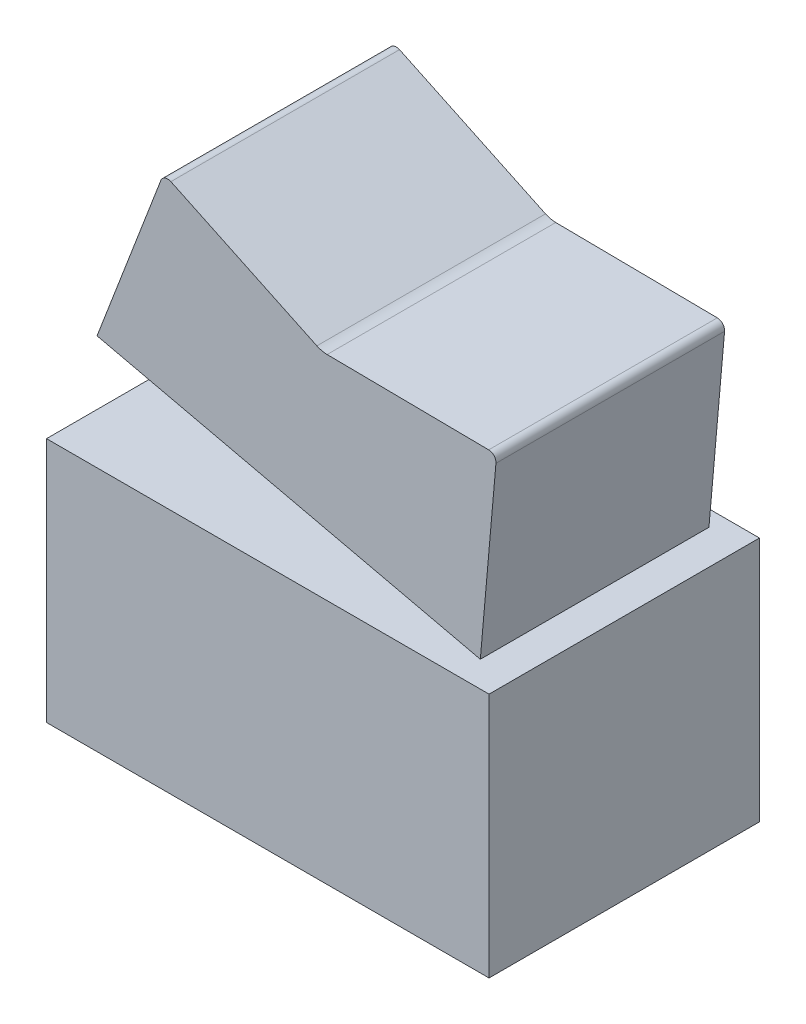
ISO-10303-21;
HEADER;
FILE_DESCRIPTION(('STEP AP214'),'2;1');
FILE_NAME('part.step','',(''),(''),'','','');
FILE_SCHEMA(('AUTOMOTIVE_DESIGN { 1 0 10303 214 1 1 1 1 }'));
ENDSEC;
DATA;
#1=APPLICATION_CONTEXT('core data for automotive mechanical design processes');
#2=APPLICATION_PROTOCOL_DEFINITION('international standard','automotive_design',2000,#1);
#3=PRODUCT_CONTEXT('',#1,'mechanical');
#4=PRODUCT('Part','Part','',(#3));
#5=PRODUCT_RELATED_PRODUCT_CATEGORY('part','',(#4));
#6=PRODUCT_DEFINITION_FORMATION('','',#4);
#7=PRODUCT_DEFINITION_CONTEXT('part definition',#1,'design');
#8=PRODUCT_DEFINITION('design','',#6,#7);
#9=PRODUCT_DEFINITION_SHAPE('','',#8);
#10=(LENGTH_UNIT() NAMED_UNIT(*) SI_UNIT(.MILLI.,.METRE.));
#11=(NAMED_UNIT(*) PLANE_ANGLE_UNIT() SI_UNIT($,.RADIAN.));
#12=(NAMED_UNIT(*) SI_UNIT($,.STERADIAN.) SOLID_ANGLE_UNIT());
#13=UNCERTAINTY_MEASURE_WITH_UNIT(LENGTH_MEASURE(1.E-05),#10,'distance_accuracy_value','');
#14=(GEOMETRIC_REPRESENTATION_CONTEXT(3) GLOBAL_UNCERTAINTY_ASSIGNED_CONTEXT((#13)) GLOBAL_UNIT_ASSIGNED_CONTEXT((#10,
#11,#12)) REPRESENTATION_CONTEXT('',''));
#15=CARTESIAN_POINT('',(0.,0.,0.));
#16=DIRECTION('',(0.,0.,1.));
#17=DIRECTION('',(1.,0.,0.));
#18=AXIS2_PLACEMENT_3D('',#15,#16,#17);
#19=CARTESIAN_POINT('',(1.574657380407,13.8205904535,-4.65));
#20=DIRECTION('',(0.,0.,1.));
#21=DIRECTION('',(1.,0.,0.));
#22=AXIS2_PLACEMENT_3D('',#19,#20,#21);
#23=CYLINDRICAL_SURFACE('',#22,1.);
#24=CARTESIAN_POINT('',(1.574657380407,13.8205904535,4.65));
#25=DIRECTION('',(0.,0.,1.));
#26=DIRECTION('',(1.,0.,0.));
#27=AXIS2_PLACEMENT_3D('',#24,#25,#26);
#28=CIRCLE('',#27,1.);
#29=CARTESIAN_POINT('',(1.56359475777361,12.8206516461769,4.65));
#30=VERTEX_POINT('',#29);
#31=CARTESIAN_POINT('',(1.14625607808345,12.9170018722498,4.65));
#32=VERTEX_POINT('',#31);
#33=EDGE_CURVE('P0_E90',#30,#32,#28,.F.);
#34=ORIENTED_EDGE('',*,*,#33,.F.);
#35=DIRECTION('',(0.,0.,1.));
#36=VECTOR('',#35,1.);
#37=CARTESIAN_POINT('',(1.56359475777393,12.8206516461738,-4.65));
#38=LINE('',#37,#36);
#39=CARTESIAN_POINT('',(1.56359475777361,12.8206516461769,-4.65));
#40=VERTEX_POINT('',#39);
#41=EDGE_CURVE('P0_E92',#40,#30,#38,.T.);
#42=ORIENTED_EDGE('',*,*,#41,.F.);
#43=CARTESIAN_POINT('',(1.574657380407,13.8205904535,-4.65));
#44=DIRECTION('',(0.,0.,1.));
#45=DIRECTION('',(1.,0.,0.));
#46=AXIS2_PLACEMENT_3D('',#43,#44,#45);
#47=CIRCLE('',#46,1.);
#48=CARTESIAN_POINT('',(1.14625607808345,12.9170018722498,-4.65));
#49=VERTEX_POINT('',#48);
#50=EDGE_CURVE('P0_E20',#49,#40,#47,.T.);
#51=ORIENTED_EDGE('',*,*,#50,.F.);
#52=DIRECTION('',(0.,0.,1.));
#53=VECTOR('',#52,1.);
#54=CARTESIAN_POINT('',(1.146256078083,12.91700187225,-4.65));
#55=LINE('',#54,#53);
#56=EDGE_CURVE('P0_E133',#32,#49,#55,.F.);
#57=ORIENTED_EDGE('',*,*,#56,.F.);
#58=EDGE_LOOP('',(#34,#42,#51,#57));
#59=FACE_BOUND('',#58,.T.);
#60=ADVANCED_FACE('P0_F17',(#59),#23,.F.);
#61=CARTESIAN_POINT('',(8.131755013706,12.44796776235,-4.65));
#62=DIRECTION('',(0.,0.,1.));
#63=DIRECTION('',(1.,0.,0.));
#64=AXIS2_PLACEMENT_3D('',#61,#62,#63);
#65=CYLINDRICAL_SURFACE('',#64,0.3);
#66=DIRECTION('',(0.,0.,1.));
#67=VECTOR('',#66,1.);
#68=CARTESIAN_POINT('',(8.43059951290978,12.4216625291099,-4.65));
#69=LINE('',#68,#67);
#70=CARTESIAN_POINT('',(8.43059951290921,12.4216625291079,-4.65));
#71=VERTEX_POINT('',#70);
#72=CARTESIAN_POINT('',(8.43059951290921,12.4216625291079,4.65));
#73=VERTEX_POINT('',#72);
#74=EDGE_CURVE('P0_E124',#71,#73,#69,.T.);
#75=ORIENTED_EDGE('',*,*,#74,.F.);
#76=CARTESIAN_POINT('',(8.131755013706,12.44796776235,-4.65));
#77=DIRECTION('',(0.,0.,1.));
#78=DIRECTION('',(1.,0.,0.));
#79=AXIS2_PLACEMENT_3D('',#76,#77,#78);
#80=CIRCLE('',#79,0.3);
#81=CARTESIAN_POINT('',(8.13507380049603,12.74794940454,-4.65));
#82=VERTEX_POINT('',#81);
#83=EDGE_CURVE('P0_E155',#71,#82,#80,.T.);
#84=ORIENTED_EDGE('',*,*,#83,.T.);
#85=DIRECTION('',(0.,0.,1.));
#86=VECTOR('',#85,1.);
#87=CARTESIAN_POINT('',(8.135073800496,12.74794940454,-4.65));
#88=LINE('',#87,#86);
#89=CARTESIAN_POINT('',(8.13507380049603,12.74794940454,4.65));
#90=VERTEX_POINT('',#89);
#91=EDGE_CURVE('P0_E96',#90,#82,#88,.F.);
#92=ORIENTED_EDGE('',*,*,#91,.F.);
#93=CARTESIAN_POINT('',(8.131755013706,12.44796776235,4.65));
#94=DIRECTION('',(0.,0.,1.));
#95=DIRECTION('',(1.,0.,0.));
#96=AXIS2_PLACEMENT_3D('',#93,#94,#95);
#97=CIRCLE('',#96,0.3);
#98=EDGE_CURVE('P0_E157',#90,#73,#97,.F.);
#99=ORIENTED_EDGE('',*,*,#98,.T.);
#100=EDGE_LOOP('',(#75,#84,#92,#99));
#101=FACE_BOUND('',#100,.T.);
#102=ADVANCED_FACE('P0_F177',(#101),#65,.T.);
#103=CARTESIAN_POINT('',(-4.920541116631,15.46132776,-4.65));
#104=DIRECTION('',(0.,0.,1.));
#105=DIRECTION('',(1.,0.,0.));
#106=AXIS2_PLACEMENT_3D('',#103,#104,#105);
#107=CYLINDRICAL_SURFACE('',#106,0.3);
#108=DIRECTION('',(0.,0.,1.));
#109=VECTOR('',#108,1.);
#110=CARTESIAN_POINT('',(-4.79202072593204,15.7324043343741,-4.65));
#111=LINE('',#110,#109);
#112=CARTESIAN_POINT('',(-4.79202072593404,15.7324043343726,-4.65));
#113=VERTEX_POINT('',#112);
#114=CARTESIAN_POINT('',(-4.79202072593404,15.7324043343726,4.65));
#115=VERTEX_POINT('',#114);
#116=EDGE_CURVE('P0_E135',#113,#115,#111,.T.);
#117=ORIENTED_EDGE('',*,*,#116,.F.);
#118=CARTESIAN_POINT('',(-4.920541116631,15.46132776,-4.65));
#119=DIRECTION('',(0.,0.,1.));
#120=DIRECTION('',(1.,0.,0.));
#121=AXIS2_PLACEMENT_3D('',#118,#119,#120);
#122=CIRCLE('',#121,0.3);
#123=CARTESIAN_POINT('',(-5.20067222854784,15.5686895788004,-4.65));
#124=VERTEX_POINT('',#123);
#125=EDGE_CURVE('P0_E97',#113,#124,#122,.T.);
#126=ORIENTED_EDGE('',*,*,#125,.T.);
#127=DIRECTION('',(0.,0.,1.));
#128=VECTOR('',#127,1.);
#129=CARTESIAN_POINT('',(-5.200672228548,15.5686895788,-4.65));
#130=LINE('',#129,#128);
#131=CARTESIAN_POINT('',(-5.20067222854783,15.5686895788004,4.65));
#132=VERTEX_POINT('',#131);
#133=EDGE_CURVE('P0_E106',#132,#124,#130,.F.);
#134=ORIENTED_EDGE('',*,*,#133,.F.);
#135=CARTESIAN_POINT('',(-4.920541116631,15.46132776,4.65));
#136=DIRECTION('',(0.,0.,1.));
#137=DIRECTION('',(1.,0.,0.));
#138=AXIS2_PLACEMENT_3D('',#135,#136,#137);
#139=CIRCLE('',#138,0.3);
#140=EDGE_CURVE('P0_E116',#115,#132,#139,.T.);
#141=ORIENTED_EDGE('',*,*,#140,.F.);
#142=EDGE_LOOP('',(#117,#126,#134,#141));
#143=FACE_BOUND('',#142,.T.);
#144=ADVANCED_FACE('P0_F168',(#143),#107,.T.);
#145=CARTESIAN_POINT('',(8.135073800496,12.74794940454,-4.65));
#146=DIRECTION('',(0.0110626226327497,0.999938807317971,0.));
#147=DIRECTION('',(-0.999938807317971,0.0110626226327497,0.));
#148=AXIS2_PLACEMENT_3D('',#145,#146,#147);
#149=PLANE('',#148);
#150=ORIENTED_EDGE('',*,*,#91,.T.);
#151=DIRECTION('',(-0.99993880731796,0.0110626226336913,0.));
#152=VECTOR('',#151,1.);
#153=CARTESIAN_POINT('',(8.135073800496,12.74794940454,-4.65));
#154=LINE('',#153,#152);
#155=EDGE_CURVE('P0_E87',#82,#40,#154,.T.);
#156=ORIENTED_EDGE('',*,*,#155,.T.);
#157=ORIENTED_EDGE('',*,*,#41,.T.);
#158=DIRECTION('',(-0.99993880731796,0.0110626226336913,0.));
#159=VECTOR('',#158,1.);
#160=CARTESIAN_POINT('',(8.135073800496,12.74794940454,4.65));
#161=LINE('',#160,#159);
#162=EDGE_CURVE('P0_E122',#90,#30,#161,.T.);
#163=ORIENTED_EDGE('',*,*,#162,.F.);
#164=EDGE_LOOP('',(#150,#156,#157,#163));
#165=FACE_BOUND('',#164,.T.);
#166=ADVANCED_FACE('P0_F100',(#165),#149,.T.);
#167=CARTESIAN_POINT('',(1.146256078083,12.91700187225,-4.65));
#168=DIRECTION('',(0.4284013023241,0.9035885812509,0.));
#169=DIRECTION('',(-0.9035885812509,0.4284013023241,0.));
#170=AXIS2_PLACEMENT_3D('',#167,#168,#169);
#171=PLANE('',#170);
#172=ORIENTED_EDGE('',*,*,#56,.T.);
#173=DIRECTION('',(-0.903588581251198,0.428401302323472,0.));
#174=VECTOR('',#173,1.);
#175=CARTESIAN_POINT('',(1.146256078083,12.91700187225,-4.65));
#176=LINE('',#175,#174);
#177=EDGE_CURVE('P0_E89',#49,#113,#176,.T.);
#178=ORIENTED_EDGE('',*,*,#177,.T.);
#179=ORIENTED_EDGE('',*,*,#116,.T.);
#180=DIRECTION('',(-0.903588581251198,0.428401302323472,0.));
#181=VECTOR('',#180,1.);
#182=CARTESIAN_POINT('',(1.146256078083,12.91700187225,4.65));
#183=LINE('',#182,#181);
#184=EDGE_CURVE('P0_E119',#32,#115,#183,.T.);
#185=ORIENTED_EDGE('',*,*,#184,.F.);
#186=EDGE_LOOP('',(#172,#178,#179,#185));
#187=FACE_BOUND('',#186,.T.);
#188=ADVANCED_FACE('P0_F163',(#187),#171,.T.);
#189=CARTESIAN_POINT('',(7.794960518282,5.200391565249,-4.65));
#190=DIRECTION('',(0.996148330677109,-0.0876841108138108,0.));
#191=DIRECTION('',(0.0876841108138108,0.996148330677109,0.));
#192=AXIS2_PLACEMENT_3D('',#189,#190,#191);
#193=PLANE('',#192);
#194=DIRECTION('',(0.,0.,1.));
#195=VECTOR('',#194,1.);
#196=CARTESIAN_POINT('',(7.79496051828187,5.20039156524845,-4.65));
#197=LINE('',#196,#195);
#198=CARTESIAN_POINT('',(7.79496051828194,5.20039156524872,-4.65));
#199=VERTEX_POINT('',#198);
#200=CARTESIAN_POINT('',(7.79496051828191,5.20039156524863,4.65));
#201=VERTEX_POINT('',#200);
#202=EDGE_CURVE('P0_E140',#199,#201,#197,.T.);
#203=ORIENTED_EDGE('',*,*,#202,.F.);
#204=DIRECTION('',(0.0876841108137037,0.996148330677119,0.));
#205=VECTOR('',#204,1.);
#206=CARTESIAN_POINT('',(7.794960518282,5.200391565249,-4.65));
#207=LINE('',#206,#205);
#208=EDGE_CURVE('P0_E102',#199,#71,#207,.T.);
#209=ORIENTED_EDGE('',*,*,#208,.T.);
#210=ORIENTED_EDGE('',*,*,#74,.T.);
#211=DIRECTION('',(0.0876841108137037,0.996148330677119,0.));
#212=VECTOR('',#211,1.);
#213=CARTESIAN_POINT('',(7.794960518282,5.200391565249,4.65));
#214=LINE('',#213,#212);
#215=EDGE_CURVE('P0_E112',#201,#73,#214,.T.);
#216=ORIENTED_EDGE('',*,*,#215,.F.);
#217=EDGE_LOOP('',(#203,#209,#210,#216));
#218=FACE_BOUND('',#217,.T.);
#219=ADVANCED_FACE('P0_F174',(#218),#193,.T.);
#220=CARTESIAN_POINT('',(0.,0.,4.65));
#221=DIRECTION('',(0.,0.,1.));
#222=DIRECTION('',(1.,0.,0.));
#223=AXIS2_PLACEMENT_3D('',#220,#221,#222);
#224=PLANE('',#223);
#225=DIRECTION('',(0.974370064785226,-0.224951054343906,0.));
#226=VECTOR('',#225,1.);
#227=CARTESIAN_POINT('',(-7.794960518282,8.799608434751,4.65));
#228=LINE('',#227,#226);
#229=CARTESIAN_POINT('',(-7.7949605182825,8.79960843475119,4.65));
#230=VERTEX_POINT('',#229);
#231=EDGE_CURVE('P0_E130',#201,#230,#228,.F.);
#232=ORIENTED_EDGE('',*,*,#231,.F.);
#233=ORIENTED_EDGE('',*,*,#215,.T.);
#234=ORIENTED_EDGE('',*,*,#98,.F.);
#235=ORIENTED_EDGE('',*,*,#162,.T.);
#236=ORIENTED_EDGE('',*,*,#33,.T.);
#237=ORIENTED_EDGE('',*,*,#184,.T.);
#238=ORIENTED_EDGE('',*,*,#140,.T.);
#239=DIRECTION('',(-0.357872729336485,-0.933770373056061,0.));
#240=VECTOR('',#239,1.);
#241=CARTESIAN_POINT('',(-5.200672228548,15.5686895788,4.65));
#242=LINE('',#241,#240);
#243=EDGE_CURVE('P0_E115',#230,#132,#242,.F.);
#244=ORIENTED_EDGE('',*,*,#243,.F.);
#245=EDGE_LOOP('',(#232,#233,#234,#235,#236,#237,#238,#244));
#246=FACE_BOUND('',#245,.T.);
#247=ADVANCED_FACE('P0_F160',(#246),#224,.T.);
#248=CARTESIAN_POINT('',(-5.200672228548,15.5686895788,-4.65));
#249=DIRECTION('',(-0.933770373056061,0.357872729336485,0.));
#250=DIRECTION('',(-0.357872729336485,-0.933770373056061,0.));
#251=AXIS2_PLACEMENT_3D('',#248,#249,#250);
#252=PLANE('',#251);
#253=ORIENTED_EDGE('',*,*,#133,.T.);
#254=DIRECTION('',(-0.357872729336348,-0.933770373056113,0.));
#255=VECTOR('',#254,1.);
#256=CARTESIAN_POINT('',(-5.200672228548,15.5686895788,-4.65));
#257=LINE('',#256,#255);
#258=CARTESIAN_POINT('',(-7.794960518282,8.799608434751,-4.65));
#259=VERTEX_POINT('',#258);
#260=EDGE_CURVE('P0_E35',#124,#259,#257,.T.);
#261=ORIENTED_EDGE('',*,*,#260,.T.);
#262=DIRECTION('',(0.,0.,1.));
#263=VECTOR('',#262,1.);
#264=CARTESIAN_POINT('',(-7.794960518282,8.799608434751,-4.65));
#265=LINE('',#264,#263);
#266=EDGE_CURVE('P0_E26',#230,#259,#265,.F.);
#267=ORIENTED_EDGE('',*,*,#266,.F.);
#268=ORIENTED_EDGE('',*,*,#243,.T.);
#269=EDGE_LOOP('',(#253,#261,#267,#268));
#270=FACE_BOUND('',#269,.T.);
#271=ADVANCED_FACE('P0_F169',(#270),#252,.T.);
#272=CARTESIAN_POINT('',(0.,0.,-4.65));
#273=DIRECTION('',(0.,0.,1.));
#274=DIRECTION('',(1.,0.,0.));
#275=AXIS2_PLACEMENT_3D('',#272,#273,#274);
#276=PLANE('',#275);
#277=ORIENTED_EDGE('',*,*,#260,.F.);
#278=ORIENTED_EDGE('',*,*,#125,.F.);
#279=ORIENTED_EDGE('',*,*,#177,.F.);
#280=ORIENTED_EDGE('',*,*,#50,.T.);
#281=ORIENTED_EDGE('',*,*,#155,.F.);
#282=ORIENTED_EDGE('',*,*,#83,.F.);
#283=ORIENTED_EDGE('',*,*,#208,.F.);
#284=DIRECTION('',(0.974370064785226,-0.224951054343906,0.));
#285=VECTOR('',#284,1.);
#286=CARTESIAN_POINT('',(-7.794960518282,8.799608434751,-4.65));
#287=LINE('',#286,#285);
#288=EDGE_CURVE('P0_E11',#259,#199,#287,.T.);
#289=ORIENTED_EDGE('',*,*,#288,.F.);
#290=EDGE_LOOP('',(#277,#278,#279,#280,#281,#282,#283,#289));
#291=FACE_BOUND('',#290,.T.);
#292=ADVANCED_FACE('P0_F85',(#291),#276,.F.);
#293=CARTESIAN_POINT('',(-7.794960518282,8.799608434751,-4.65));
#294=DIRECTION('',(-0.224951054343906,-0.974370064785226,0.));
#295=DIRECTION('',(0.974370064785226,-0.224951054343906,0.));
#296=AXIS2_PLACEMENT_3D('',#293,#294,#295);
#297=PLANE('',#296);
#298=ORIENTED_EDGE('',*,*,#266,.T.);
#299=ORIENTED_EDGE('',*,*,#288,.T.);
#300=ORIENTED_EDGE('',*,*,#202,.T.);
#301=ORIENTED_EDGE('',*,*,#231,.T.);
#302=EDGE_LOOP('',(#298,#299,#300,#301));
#303=FACE_BOUND('',#302,.T.);
#304=ADVANCED_FACE('P0_F171',(#303),#297,.T.);
#305=CLOSED_SHELL('',(#60,#102,#144,#166,#188,#219,#247,#271,#292,#304));
#306=MANIFOLD_SOLID_BREP('P0_B1',#305);
#307=CARTESIAN_POINT('',(0.,5.,0.));
#308=DIRECTION('',(0.,1.,0.));
#309=DIRECTION('',(0.,0.,1.));
#310=AXIS2_PLACEMENT_3D('',#307,#308,#309);
#311=PLANE('',#310);
#312=DIRECTION('',(1.,0.,0.));
#313=VECTOR('',#312,1.);
#314=CARTESIAN_POINT('',(-9.,5.,5.5));
#315=LINE('',#314,#313);
#316=CARTESIAN_POINT('',(9.,5.,5.5));
#317=VERTEX_POINT('',#316);
#318=CARTESIAN_POINT('',(-9.,5.,5.5));
#319=VERTEX_POINT('',#318);
#320=EDGE_CURVE('P1_E77',#317,#319,#315,.F.);
#321=ORIENTED_EDGE('',*,*,#320,.F.);
#322=DIRECTION('',(0.,0.,-1.));
#323=VECTOR('',#322,1.);
#324=CARTESIAN_POINT('',(9.,5.,5.5));
#325=LINE('',#324,#323);
#326=CARTESIAN_POINT('',(9.,5.,-5.5));
#327=VERTEX_POINT('',#326);
#328=EDGE_CURVE('P1_E20',#327,#317,#325,.F.);
#329=ORIENTED_EDGE('',*,*,#328,.F.);
#330=DIRECTION('',(-1.,0.,0.));
#331=VECTOR('',#330,1.);
#332=CARTESIAN_POINT('',(9.,5.,-5.5));
#333=LINE('',#332,#331);
#334=CARTESIAN_POINT('',(-9.,5.,-5.5));
#335=VERTEX_POINT('',#334);
#336=EDGE_CURVE('P1_E67',#335,#327,#333,.F.);
#337=ORIENTED_EDGE('',*,*,#336,.F.);
#338=DIRECTION('',(0.,0.,1.));
#339=VECTOR('',#338,1.);
#340=CARTESIAN_POINT('',(-9.,5.,-5.5));
#341=LINE('',#340,#339);
#342=EDGE_CURVE('P1_E62',#319,#335,#341,.F.);
#343=ORIENTED_EDGE('',*,*,#342,.F.);
#344=EDGE_LOOP('',(#321,#329,#337,#343));
#345=FACE_BOUND('',#344,.T.);
#346=ADVANCED_FACE('P1_F17',(#345),#311,.T.);
#347=CARTESIAN_POINT('',(9.,-5.,5.5));
#348=DIRECTION('',(1.,0.,0.));
#349=DIRECTION('',(0.,0.,-1.));
#350=AXIS2_PLACEMENT_3D('',#347,#348,#349);
#351=PLANE('',#350);
#352=DIRECTION('',(0.,1.,0.));
#353=VECTOR('',#352,1.);
#354=CARTESIAN_POINT('',(9.,-5.,5.5));
#355=LINE('',#354,#353);
#356=CARTESIAN_POINT('',(9.,-5.,5.5));
#357=VERTEX_POINT('',#356);
#358=EDGE_CURVE('P1_E93',#357,#317,#355,.T.);
#359=ORIENTED_EDGE('',*,*,#358,.F.);
#360=DIRECTION('',(0.,0.,1.));
#361=VECTOR('',#360,1.);
#362=CARTESIAN_POINT('',(9.,-5.,0.));
#363=LINE('',#362,#361);
#364=CARTESIAN_POINT('',(9.,-5.,-5.5));
#365=VERTEX_POINT('',#364);
#366=EDGE_CURVE('P1_E84',#357,#365,#363,.F.);
#367=ORIENTED_EDGE('',*,*,#366,.T.);
#368=DIRECTION('',(0.,1.,0.));
#369=VECTOR('',#368,1.);
#370=CARTESIAN_POINT('',(9.,-5.,-5.5));
#371=LINE('',#370,#369);
#372=EDGE_CURVE('P1_E72',#327,#365,#371,.F.);
#373=ORIENTED_EDGE('',*,*,#372,.F.);
#374=ORIENTED_EDGE('',*,*,#328,.T.);
#375=EDGE_LOOP('',(#359,#367,#373,#374));
#376=FACE_BOUND('',#375,.T.);
#377=ADVANCED_FACE('P1_F83',(#376),#351,.T.);
#378=CARTESIAN_POINT('',(9.,-5.,-5.5));
#379=DIRECTION('',(0.,0.,-1.));
#380=DIRECTION('',(-1.,0.,0.));
#381=AXIS2_PLACEMENT_3D('',#378,#379,#380);
#382=PLANE('',#381);
#383=ORIENTED_EDGE('',*,*,#372,.T.);
#384=DIRECTION('',(1.,0.,0.));
#385=VECTOR('',#384,1.);
#386=CARTESIAN_POINT('',(0.,-5.,-5.5));
#387=LINE('',#386,#385);
#388=CARTESIAN_POINT('',(-9.,-5.,-5.5));
#389=VERTEX_POINT('',#388);
#390=EDGE_CURVE('P1_E102',#365,#389,#387,.F.);
#391=ORIENTED_EDGE('',*,*,#390,.T.);
#392=DIRECTION('',(0.,1.,0.));
#393=VECTOR('',#392,1.);
#394=CARTESIAN_POINT('',(-9.,-5.,-5.5));
#395=LINE('',#394,#393);
#396=EDGE_CURVE('P1_E74',#335,#389,#395,.F.);
#397=ORIENTED_EDGE('',*,*,#396,.F.);
#398=ORIENTED_EDGE('',*,*,#336,.T.);
#399=EDGE_LOOP('',(#383,#391,#397,#398));
#400=FACE_BOUND('',#399,.T.);
#401=ADVANCED_FACE('P1_F69',(#400),#382,.T.);
#402=CARTESIAN_POINT('',(-9.,-5.,-5.5));
#403=DIRECTION('',(-1.,0.,0.));
#404=DIRECTION('',(0.,0.,1.));
#405=AXIS2_PLACEMENT_3D('',#402,#403,#404);
#406=PLANE('',#405);
#407=ORIENTED_EDGE('',*,*,#396,.T.);
#408=DIRECTION('',(0.,0.,1.));
#409=VECTOR('',#408,1.);
#410=CARTESIAN_POINT('',(-9.,-5.,0.));
#411=LINE('',#410,#409);
#412=CARTESIAN_POINT('',(-9.,-5.,5.5));
#413=VERTEX_POINT('',#412);
#414=EDGE_CURVE('P1_E27',#389,#413,#411,.T.);
#415=ORIENTED_EDGE('',*,*,#414,.T.);
#416=DIRECTION('',(0.,1.,0.));
#417=VECTOR('',#416,1.);
#418=CARTESIAN_POINT('',(-9.,-5.,5.5));
#419=LINE('',#418,#417);
#420=EDGE_CURVE('P1_E39',#319,#413,#419,.F.);
#421=ORIENTED_EDGE('',*,*,#420,.F.);
#422=ORIENTED_EDGE('',*,*,#342,.T.);
#423=EDGE_LOOP('',(#407,#415,#421,#422));
#424=FACE_BOUND('',#423,.T.);
#425=ADVANCED_FACE('P1_F107',(#424),#406,.T.);
#426=CARTESIAN_POINT('',(-9.,-5.,5.5));
#427=DIRECTION('',(0.,0.,1.));
#428=DIRECTION('',(1.,0.,0.));
#429=AXIS2_PLACEMENT_3D('',#426,#427,#428);
#430=PLANE('',#429);
#431=ORIENTED_EDGE('',*,*,#420,.T.);
#432=DIRECTION('',(1.,0.,0.));
#433=VECTOR('',#432,1.);
#434=CARTESIAN_POINT('',(0.,-5.,5.5));
#435=LINE('',#434,#433);
#436=EDGE_CURVE('P1_E11',#413,#357,#435,.T.);
#437=ORIENTED_EDGE('',*,*,#436,.T.);
#438=ORIENTED_EDGE('',*,*,#358,.T.);
#439=ORIENTED_EDGE('',*,*,#320,.T.);
#440=EDGE_LOOP('',(#431,#437,#438,#439));
#441=FACE_BOUND('',#440,.T.);
#442=ADVANCED_FACE('P1_F110',(#441),#430,.T.);
#443=CARTESIAN_POINT('',(0.,-5.,0.));
#444=DIRECTION('',(0.,1.,0.));
#445=DIRECTION('',(0.,0.,1.));
#446=AXIS2_PLACEMENT_3D('',#443,#444,#445);
#447=PLANE('',#446);
#448=ORIENTED_EDGE('',*,*,#414,.F.);
#449=ORIENTED_EDGE('',*,*,#390,.F.);
#450=ORIENTED_EDGE('',*,*,#366,.F.);
#451=ORIENTED_EDGE('',*,*,#436,.F.);
#452=EDGE_LOOP('',(#448,#449,#450,#451));
#453=FACE_BOUND('',#452,.T.);
#454=ADVANCED_FACE('P1_F109',(#453),#447,.F.);
#455=CLOSED_SHELL('',(#346,#377,#401,#425,#442,#454));
#456=MANIFOLD_SOLID_BREP('P1_B1',#455);
#457=ADVANCED_BREP_SHAPE_REPRESENTATION('',(#18,#306,#456),#14);
#458=SHAPE_DEFINITION_REPRESENTATION(#9,#457);
ENDSEC;
END-ISO-10303-21;
